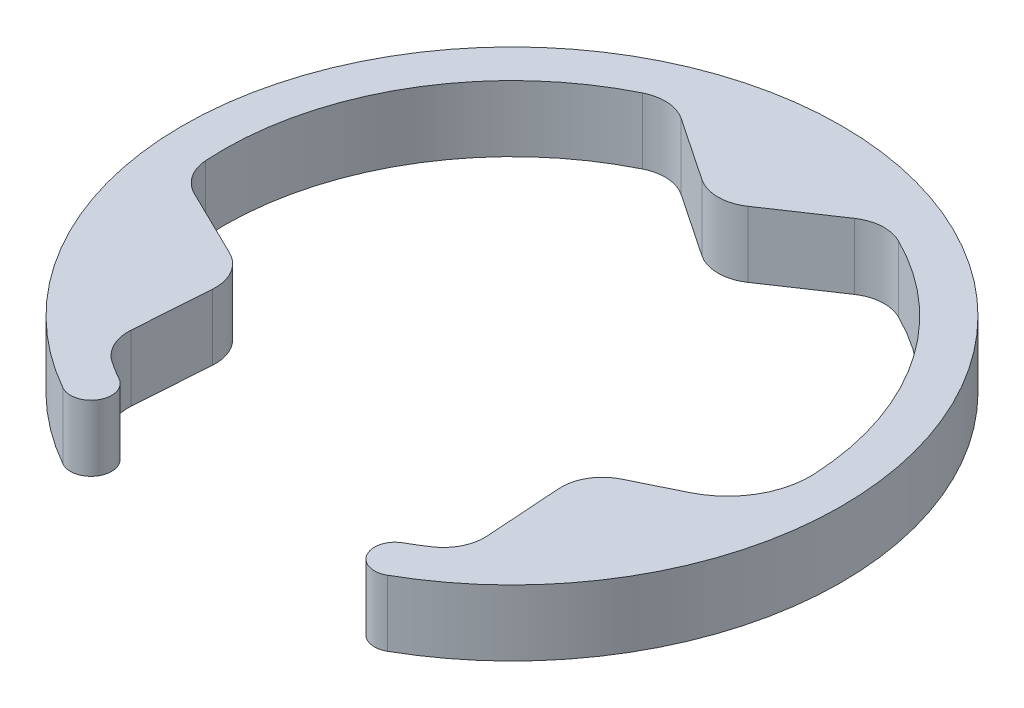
ISO-10303-21;
HEADER;
FILE_DESCRIPTION(('STEP AP214'),'2;1');
FILE_NAME('part.step','',(''),(''),'','','');
FILE_SCHEMA(('AUTOMOTIVE_DESIGN { 1 0 10303 214 1 1 1 1 }'));
ENDSEC;
DATA;
#1=APPLICATION_CONTEXT('core data for automotive mechanical design processes');
#2=APPLICATION_PROTOCOL_DEFINITION('international standard','automotive_design',2000,#1);
#3=PRODUCT_CONTEXT('',#1,'mechanical');
#4=PRODUCT('Part','Part','',(#3));
#5=PRODUCT_RELATED_PRODUCT_CATEGORY('part','',(#4));
#6=PRODUCT_DEFINITION_FORMATION('','',#4);
#7=PRODUCT_DEFINITION_CONTEXT('part definition',#1,'design');
#8=PRODUCT_DEFINITION('design','',#6,#7);
#9=PRODUCT_DEFINITION_SHAPE('','',#8);
#10=(LENGTH_UNIT() NAMED_UNIT(*) SI_UNIT(.MILLI.,.METRE.));
#11=(NAMED_UNIT(*) PLANE_ANGLE_UNIT() SI_UNIT($,.RADIAN.));
#12=(NAMED_UNIT(*) SI_UNIT($,.STERADIAN.) SOLID_ANGLE_UNIT());
#13=UNCERTAINTY_MEASURE_WITH_UNIT(LENGTH_MEASURE(1.E-05),#10,'distance_accuracy_value','');
#14=(GEOMETRIC_REPRESENTATION_CONTEXT(3) GLOBAL_UNCERTAINTY_ASSIGNED_CONTEXT((#13)) GLOBAL_UNIT_ASSIGNED_CONTEXT((#10,
#11,#12)) REPRESENTATION_CONTEXT('',''));
#15=CARTESIAN_POINT('',(0.,0.,0.));
#16=DIRECTION('',(0.,0.,1.));
#17=DIRECTION('',(1.,0.,0.));
#18=AXIS2_PLACEMENT_3D('',#15,#16,#17);
#19=CARTESIAN_POINT('',(1.66394913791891,0.,2.49625184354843));
#20=DIRECTION('',(0.,1.,0.));
#21=DIRECTION('',(0.,0.,1.));
#22=AXIS2_PLACEMENT_3D('',#19,#20,#21);
#23=CYLINDRICAL_SURFACE('',#22,0.499999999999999);
#24=CARTESIAN_POINT('',(1.66394913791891,0.8,2.49625184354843));
#25=DIRECTION('',(0.,-1.,0.));
#26=DIRECTION('',(0.,0.,-1.));
#27=AXIS2_PLACEMENT_3D('',#24,#25,#26);
#28=CIRCLE('',#27,0.499999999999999);
#29=CARTESIAN_POINT('',(2.1627811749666,0.8,2.46209633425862));
#30=VERTEX_POINT('',#29);
#31=CARTESIAN_POINT('',(1.94127399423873,0.8,2.91229381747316));
#32=VERTEX_POINT('',#31);
#33=EDGE_CURVE('E213',#30,#32,#28,.T.);
#34=ORIENTED_EDGE('',*,*,#33,.F.);
#35=DIRECTION('',(0.,1.,0.));
#36=VECTOR('',#35,1.);
#37=CARTESIAN_POINT('',(2.1627811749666,0.,2.46209633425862));
#38=LINE('',#37,#36);
#39=CARTESIAN_POINT('',(2.1627811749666,0.,2.46209633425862));
#40=VERTEX_POINT('',#39);
#41=EDGE_CURVE('E11',#40,#30,#38,.T.);
#42=ORIENTED_EDGE('',*,*,#41,.F.);
#43=CARTESIAN_POINT('',(1.66394913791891,0.,2.49625184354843));
#44=DIRECTION('',(0.,-1.,0.));
#45=DIRECTION('',(0.,0.,-1.));
#46=AXIS2_PLACEMENT_3D('',#43,#44,#45);
#47=CIRCLE('',#46,0.499999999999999);
#48=CARTESIAN_POINT('',(1.94127399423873,0.,2.91229381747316));
#49=VERTEX_POINT('',#48);
#50=EDGE_CURVE('E275',#40,#49,#47,.T.);
#51=ORIENTED_EDGE('',*,*,#50,.T.);
#52=DIRECTION('',(0.,1.,0.));
#53=VECTOR('',#52,1.);
#54=CARTESIAN_POINT('',(1.94127399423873,0.,2.91229381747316));
#55=LINE('',#54,#53);
#56=EDGE_CURVE('E35',#49,#32,#55,.T.);
#57=ORIENTED_EDGE('',*,*,#56,.T.);
#58=EDGE_LOOP('',(#34,#42,#51,#57));
#59=FACE_BOUND('',#58,.T.);
#60=ADVANCED_FACE('F32',(#59),#23,.F.);
#61=CARTESIAN_POINT('',(2.09924417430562,0.,1.53415550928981));
#62=DIRECTION('',(-0.997664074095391,0.,0.0683110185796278));
#63=DIRECTION('',(0.0683110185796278,0.,0.997664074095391));
#64=AXIS2_PLACEMENT_3D('',#61,#62,#63);
#65=PLANE('',#64);
#66=DIRECTION('',(0.0683110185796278,0.,0.997664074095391));
#67=VECTOR('',#66,1.);
#68=CARTESIAN_POINT('',(2.09924417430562,0.8,1.53415550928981));
#69=LINE('',#68,#67);
#70=CARTESIAN_POINT('',(2.09924417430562,0.8,1.53415550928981));
#71=VERTEX_POINT('',#70);
#72=EDGE_CURVE('E273',#71,#30,#69,.T.);
#73=ORIENTED_EDGE('',*,*,#72,.F.);
#74=DIRECTION('',(0.,1.,0.));
#75=VECTOR('',#74,1.);
#76=CARTESIAN_POINT('',(2.09924417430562,0.,1.53415550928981));
#77=LINE('',#76,#75);
#78=CARTESIAN_POINT('',(2.09924417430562,0.,1.53415550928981));
#79=VERTEX_POINT('',#78);
#80=EDGE_CURVE('E41',#79,#71,#77,.T.);
#81=ORIENTED_EDGE('',*,*,#80,.F.);
#82=DIRECTION('',(0.0683110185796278,0.,0.997664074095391));
#83=VECTOR('',#82,1.);
#84=CARTESIAN_POINT('',(2.09924417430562,0.,1.53415550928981));
#85=LINE('',#84,#83);
#86=EDGE_CURVE('E203',#79,#40,#85,.T.);
#87=ORIENTED_EDGE('',*,*,#86,.T.);
#88=ORIENTED_EDGE('',*,*,#41,.T.);
#89=EDGE_LOOP('',(#73,#81,#87,#88));
#90=FACE_BOUND('',#89,.T.);
#91=ADVANCED_FACE('F315',(#90),#65,.T.);
#92=CARTESIAN_POINT('',(2.59807621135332,0.,1.5));
#93=DIRECTION('',(0.,1.,0.));
#94=DIRECTION('',(0.,0.,1.));
#95=AXIS2_PLACEMENT_3D('',#92,#93,#94);
#96=CYLINDRICAL_SURFACE('',#95,0.5);
#97=CARTESIAN_POINT('',(2.59807621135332,0.8,1.5));
#98=DIRECTION('',(0.,1.,0.));
#99=DIRECTION('',(0.,0.,1.));
#100=AXIS2_PLACEMENT_3D('',#97,#98,#99);
#101=CIRCLE('',#100,0.5);
#102=CARTESIAN_POINT('',(2.37823973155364,0.8,1.05092102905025));
#103=VERTEX_POINT('',#102);
#104=EDGE_CURVE('E190',#103,#71,#101,.T.);
#105=ORIENTED_EDGE('',*,*,#104,.F.);
#106=DIRECTION('',(0.,1.,0.));
#107=VECTOR('',#106,1.);
#108=CARTESIAN_POINT('',(2.37823973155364,0.,1.05092102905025));
#109=LINE('',#108,#107);
#110=CARTESIAN_POINT('',(2.37823973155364,0.,1.05092102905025));
#111=VERTEX_POINT('',#110);
#112=EDGE_CURVE('E185',#111,#103,#109,.T.);
#113=ORIENTED_EDGE('',*,*,#112,.F.);
#114=CARTESIAN_POINT('',(2.59807621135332,0.,1.5));
#115=DIRECTION('',(0.,1.,0.));
#116=DIRECTION('',(0.,0.,1.));
#117=AXIS2_PLACEMENT_3D('',#114,#115,#116);
#118=CIRCLE('',#117,0.5);
#119=EDGE_CURVE('E188',#111,#79,#118,.T.);
#120=ORIENTED_EDGE('',*,*,#119,.T.);
#121=ORIENTED_EDGE('',*,*,#80,.T.);
#122=EDGE_LOOP('',(#105,#113,#120,#121));
#123=FACE_BOUND('',#122,.T.);
#124=ADVANCED_FACE('F187',(#123),#96,.T.);
#125=CARTESIAN_POINT('',(2.93676007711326,0.,0.777509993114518));
#126=DIRECTION('',(-0.439672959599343,0.,-0.898157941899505));
#127=DIRECTION('',(-0.898157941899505,0.,0.439672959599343));
#128=AXIS2_PLACEMENT_3D('',#125,#126,#127);
#129=PLANE('',#128);
#130=DIRECTION('',(-0.898157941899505,0.,0.439672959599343));
#131=VECTOR('',#130,1.);
#132=CARTESIAN_POINT('',(2.93676007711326,0.8,0.777509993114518));
#133=LINE('',#132,#131);
#134=CARTESIAN_POINT('',(2.93676007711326,0.8,0.777509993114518));
#135=VERTEX_POINT('',#134);
#136=EDGE_CURVE('E270',#135,#103,#133,.T.);
#137=ORIENTED_EDGE('',*,*,#136,.F.);
#138=DIRECTION('',(0.,1.,0.));
#139=VECTOR('',#138,1.);
#140=CARTESIAN_POINT('',(2.93676007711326,0.,0.777509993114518));
#141=LINE('',#140,#139);
#142=CARTESIAN_POINT('',(2.93676007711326,0.,0.777509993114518));
#143=VERTEX_POINT('',#142);
#144=EDGE_CURVE('E195',#143,#135,#141,.T.);
#145=ORIENTED_EDGE('',*,*,#144,.F.);
#146=DIRECTION('',(-0.898157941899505,0.,0.439672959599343));
#147=VECTOR('',#146,1.);
#148=CARTESIAN_POINT('',(2.93676007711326,0.,0.777509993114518));
#149=LINE('',#148,#147);
#150=EDGE_CURVE('E201',#143,#111,#149,.T.);
#151=ORIENTED_EDGE('',*,*,#150,.T.);
#152=ORIENTED_EDGE('',*,*,#112,.T.);
#153=EDGE_LOOP('',(#137,#145,#151,#152));
#154=FACE_BOUND('',#153,.T.);
#155=ADVANCED_FACE('F205',(#154),#129,.T.);
#156=CARTESIAN_POINT('',(2.49708711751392,0.,-0.120647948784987));
#157=DIRECTION('',(0.,1.,0.));
#158=DIRECTION('',(0.,0.,1.));
#159=AXIS2_PLACEMENT_3D('',#156,#157,#158);
#160=CYLINDRICAL_SURFACE('',#159,1.);
#161=CARTESIAN_POINT('',(2.49708711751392,0.8,-0.120647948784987));
#162=DIRECTION('',(0.,-1.,0.));
#163=DIRECTION('',(0.,0.,-1.));
#164=AXIS2_PLACEMENT_3D('',#161,#162,#163);
#165=CIRCLE('',#164,1.);
#166=CARTESIAN_POINT('',(3.49592196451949,0.8,-0.168907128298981));
#167=VERTEX_POINT('',#166);
#168=EDGE_CURVE('E267',#167,#135,#165,.T.);
#169=ORIENTED_EDGE('',*,*,#168,.F.);
#170=DIRECTION('',(0.,1.,0.));
#171=VECTOR('',#170,1.);
#172=CARTESIAN_POINT('',(3.49592196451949,0.,-0.168907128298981));
#173=LINE('',#172,#171);
#174=CARTESIAN_POINT('',(3.49592196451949,0.,-0.168907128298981));
#175=VERTEX_POINT('',#174);
#176=EDGE_CURVE('E279',#175,#167,#173,.T.);
#177=ORIENTED_EDGE('',*,*,#176,.F.);
#178=CARTESIAN_POINT('',(2.49708711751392,0.,-0.120647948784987));
#179=DIRECTION('',(0.,-1.,0.));
#180=DIRECTION('',(0.,0.,-1.));
#181=AXIS2_PLACEMENT_3D('',#178,#179,#180);
#182=CIRCLE('',#181,1.);
#183=EDGE_CURVE('E206',#175,#143,#182,.T.);
#184=ORIENTED_EDGE('',*,*,#183,.T.);
#185=ORIENTED_EDGE('',*,*,#144,.T.);
#186=EDGE_LOOP('',(#169,#177,#184,#185));
#187=FACE_BOUND('',#186,.T.);
#188=ADVANCED_FACE('F328',(#187),#160,.F.);
#189=CARTESIAN_POINT('',(0.,0.,0.));
#190=DIRECTION('',(0.,1.,0.));
#191=DIRECTION('',(0.,0.,1.));
#192=AXIS2_PLACEMENT_3D('',#189,#190,#191);
#193=CYLINDRICAL_SURFACE('',#192,3.5);
#194=CARTESIAN_POINT('',(0.,0.8,0.));
#195=DIRECTION('',(0.,-1.,0.));
#196=DIRECTION('',(0.,0.,-1.));
#197=AXIS2_PLACEMENT_3D('',#194,#195,#196);
#198=CIRCLE('',#197,3.5);
#199=CARTESIAN_POINT('',(1.55148343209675,0.8,-3.13733950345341));
#200=VERTEX_POINT('',#199);
#201=EDGE_CURVE('E264',#200,#167,#198,.T.);
#202=ORIENTED_EDGE('',*,*,#201,.F.);
#203=DIRECTION('',(0.,1.,0.));
#204=VECTOR('',#203,1.);
#205=CARTESIAN_POINT('',(1.55148343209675,0.,-3.13733950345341));
#206=LINE('',#205,#204);
#207=CARTESIAN_POINT('',(1.55148343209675,0.,-3.13733950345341));
#208=VERTEX_POINT('',#207);
#209=EDGE_CURVE('E281',#208,#200,#206,.T.);
#210=ORIENTED_EDGE('',*,*,#209,.F.);
#211=CARTESIAN_POINT('',(0.,0.,0.));
#212=DIRECTION('',(0.,-1.,0.));
#213=DIRECTION('',(0.,0.,-1.));
#214=AXIS2_PLACEMENT_3D('',#211,#212,#213);
#215=CIRCLE('',#214,3.5);
#216=EDGE_CURVE('E208',#208,#175,#215,.T.);
#217=ORIENTED_EDGE('',*,*,#216,.T.);
#218=ORIENTED_EDGE('',*,*,#176,.T.);
#219=EDGE_LOOP('',(#202,#210,#217,#218));
#220=FACE_BOUND('',#219,.T.);
#221=ADVANCED_FACE('F331',(#220),#193,.F.);
#222=CARTESIAN_POINT('',(1.32984294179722,0.,-2.68914814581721));
#223=DIRECTION('',(0.,1.,0.));
#224=DIRECTION('',(0.,0.,1.));
#225=AXIS2_PLACEMENT_3D('',#222,#223,#224);
#226=CYLINDRICAL_SURFACE('',#225,0.5);
#227=CARTESIAN_POINT('',(1.32984294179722,0.8,-2.68914814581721));
#228=DIRECTION('',(0.,-1.,0.));
#229=DIRECTION('',(0.,0.,-1.));
#230=AXIS2_PLACEMENT_3D('',#227,#228,#229);
#231=CIRCLE('',#230,0.5);
#232=CARTESIAN_POINT('',(1.0508473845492,0.8,-3.10407160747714));
#233=VERTEX_POINT('',#232);
#234=EDGE_CURVE('E261',#233,#200,#231,.T.);
#235=ORIENTED_EDGE('',*,*,#234,.F.);
#236=DIRECTION('',(0.,1.,0.));
#237=VECTOR('',#236,1.);
#238=CARTESIAN_POINT('',(1.0508473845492,0.,-3.10407160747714));
#239=LINE('',#238,#237);
#240=CARTESIAN_POINT('',(1.0508473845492,0.,-3.10407160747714));
#241=VERTEX_POINT('',#240);
#242=EDGE_CURVE('E283',#241,#233,#239,.T.);
#243=ORIENTED_EDGE('',*,*,#242,.F.);
#244=CARTESIAN_POINT('',(1.32984294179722,0.,-2.68914814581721));
#245=DIRECTION('',(0.,-1.,0.));
#246=DIRECTION('',(0.,0.,-1.));
#247=AXIS2_PLACEMENT_3D('',#244,#245,#246);
#248=CIRCLE('',#247,0.5);
#249=EDGE_CURVE('E594',#241,#208,#248,.T.);
#250=ORIENTED_EDGE('',*,*,#249,.T.);
#251=ORIENTED_EDGE('',*,*,#209,.T.);
#252=EDGE_LOOP('',(#235,#243,#250,#251));
#253=FACE_BOUND('',#252,.T.);
#254=ADVANCED_FACE('F335',(#253),#226,.F.);
#255=CARTESIAN_POINT('',(0.278995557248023,0.,-2.58507653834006));
#256=DIRECTION('',(0.557991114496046,0.,0.829846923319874));
#257=DIRECTION('',(0.829846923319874,0.,-0.557991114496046));
#258=AXIS2_PLACEMENT_3D('',#255,#256,#257);
#259=PLANE('',#258);
#260=DIRECTION('',(0.829846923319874,0.,-0.557991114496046));
#261=VECTOR('',#260,1.);
#262=CARTESIAN_POINT('',(0.278995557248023,0.8,-2.58507653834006));
#263=LINE('',#262,#261);
#264=CARTESIAN_POINT('',(0.278995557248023,0.8,-2.58507653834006));
#265=VERTEX_POINT('',#264);
#266=EDGE_CURVE('E258',#265,#233,#263,.T.);
#267=ORIENTED_EDGE('',*,*,#266,.F.);
#268=DIRECTION('',(0.,1.,0.));
#269=VECTOR('',#268,1.);
#270=CARTESIAN_POINT('',(0.278995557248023,0.,-2.58507653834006));
#271=LINE('',#270,#269);
#272=CARTESIAN_POINT('',(0.278995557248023,0.,-2.58507653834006));
#273=VERTEX_POINT('',#272);
#274=EDGE_CURVE('E285',#273,#265,#271,.T.);
#275=ORIENTED_EDGE('',*,*,#274,.F.);
#276=DIRECTION('',(0.829846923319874,0.,-0.557991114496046));
#277=VECTOR('',#276,1.);
#278=CARTESIAN_POINT('',(0.278995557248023,0.,-2.58507653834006));
#279=LINE('',#278,#277);
#280=EDGE_CURVE('E590',#273,#241,#279,.T.);
#281=ORIENTED_EDGE('',*,*,#280,.T.);
#282=ORIENTED_EDGE('',*,*,#242,.T.);
#283=EDGE_LOOP('',(#267,#275,#281,#282));
#284=FACE_BOUND('',#283,.T.);
#285=ADVANCED_FACE('F339',(#284),#259,.T.);
#286=CARTESIAN_POINT('',(0.,0.,-3.));
#287=DIRECTION('',(0.,1.,0.));
#288=DIRECTION('',(0.,0.,1.));
#289=AXIS2_PLACEMENT_3D('',#286,#287,#288);
#290=CYLINDRICAL_SURFACE('',#289,0.499999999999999);
#291=CARTESIAN_POINT('',(0.,0.8,-3.));
#292=DIRECTION('',(0.,1.,0.));
#293=DIRECTION('',(0.,0.,1.));
#294=AXIS2_PLACEMENT_3D('',#291,#292,#293);
#295=CIRCLE('',#294,0.499999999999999);
#296=CARTESIAN_POINT('',(-0.278995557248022,0.8,-2.58507653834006));
#297=VERTEX_POINT('',#296);
#298=EDGE_CURVE('E255',#297,#265,#295,.T.);
#299=ORIENTED_EDGE('',*,*,#298,.F.);
#300=DIRECTION('',(0.,1.,0.));
#301=VECTOR('',#300,1.);
#302=CARTESIAN_POINT('',(-0.278995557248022,0.,-2.58507653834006));
#303=LINE('',#302,#301);
#304=CARTESIAN_POINT('',(-0.278995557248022,0.,-2.58507653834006));
#305=VERTEX_POINT('',#304);
#306=EDGE_CURVE('E287',#305,#297,#303,.T.);
#307=ORIENTED_EDGE('',*,*,#306,.F.);
#308=CARTESIAN_POINT('',(0.,0.,-3.));
#309=DIRECTION('',(0.,1.,0.));
#310=DIRECTION('',(0.,0.,1.));
#311=AXIS2_PLACEMENT_3D('',#308,#309,#310);
#312=CIRCLE('',#311,0.499999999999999);
#313=EDGE_CURVE('E601',#305,#273,#312,.T.);
#314=ORIENTED_EDGE('',*,*,#313,.T.);
#315=ORIENTED_EDGE('',*,*,#274,.T.);
#316=EDGE_LOOP('',(#299,#307,#314,#315));
#317=FACE_BOUND('',#316,.T.);
#318=ADVANCED_FACE('F343',(#317),#290,.T.);
#319=CARTESIAN_POINT('',(-1.0508473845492,0.,-3.10407160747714));
#320=DIRECTION('',(-0.557991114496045,0.,0.829846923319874));
#321=DIRECTION('',(0.829846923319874,0.,0.557991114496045));
#322=AXIS2_PLACEMENT_3D('',#319,#320,#321);
#323=PLANE('',#322);
#324=DIRECTION('',(0.829846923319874,0.,0.557991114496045));
#325=VECTOR('',#324,1.);
#326=CARTESIAN_POINT('',(-1.0508473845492,0.8,-3.10407160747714));
#327=LINE('',#326,#325);
#328=CARTESIAN_POINT('',(-1.0508473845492,0.8,-3.10407160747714));
#329=VERTEX_POINT('',#328);
#330=EDGE_CURVE('E252',#329,#297,#327,.T.);
#331=ORIENTED_EDGE('',*,*,#330,.F.);
#332=DIRECTION('',(0.,1.,0.));
#333=VECTOR('',#332,1.);
#334=CARTESIAN_POINT('',(-1.0508473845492,0.,-3.10407160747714));
#335=LINE('',#334,#333);
#336=CARTESIAN_POINT('',(-1.0508473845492,0.,-3.10407160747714));
#337=VERTEX_POINT('',#336);
#338=EDGE_CURVE('E289',#337,#329,#335,.T.);
#339=ORIENTED_EDGE('',*,*,#338,.F.);
#340=DIRECTION('',(0.829846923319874,0.,0.557991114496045));
#341=VECTOR('',#340,1.);
#342=CARTESIAN_POINT('',(-1.0508473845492,0.,-3.10407160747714));
#343=LINE('',#342,#341);
#344=EDGE_CURVE('E583',#337,#305,#343,.T.);
#345=ORIENTED_EDGE('',*,*,#344,.T.);
#346=ORIENTED_EDGE('',*,*,#306,.T.);
#347=EDGE_LOOP('',(#331,#339,#345,#346));
#348=FACE_BOUND('',#347,.T.);
#349=ADVANCED_FACE('F347',(#348),#323,.T.);
#350=CARTESIAN_POINT('',(-1.32984294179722,0.,-2.68914814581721));
#351=DIRECTION('',(0.,1.,0.));
#352=DIRECTION('',(0.,0.,1.));
#353=AXIS2_PLACEMENT_3D('',#350,#351,#352);
#354=CYLINDRICAL_SURFACE('',#353,0.5);
#355=CARTESIAN_POINT('',(-1.32984294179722,0.8,-2.68914814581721));
#356=DIRECTION('',(0.,-1.,0.));
#357=DIRECTION('',(0.,0.,-1.));
#358=AXIS2_PLACEMENT_3D('',#355,#356,#357);
#359=CIRCLE('',#358,0.5);
#360=CARTESIAN_POINT('',(-1.55148343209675,0.8,-3.13733950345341));
#361=VERTEX_POINT('',#360);
#362=EDGE_CURVE('E249',#361,#329,#359,.T.);
#363=ORIENTED_EDGE('',*,*,#362,.F.);
#364=DIRECTION('',(0.,1.,0.));
#365=VECTOR('',#364,1.);
#366=CARTESIAN_POINT('',(-1.55148343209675,0.,-3.13733950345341));
#367=LINE('',#366,#365);
#368=CARTESIAN_POINT('',(-1.55148343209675,0.,-3.13733950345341));
#369=VERTEX_POINT('',#368);
#370=EDGE_CURVE('E291',#369,#361,#367,.T.);
#371=ORIENTED_EDGE('',*,*,#370,.F.);
#372=CARTESIAN_POINT('',(-1.32984294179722,0.,-2.68914814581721));
#373=DIRECTION('',(0.,-1.,0.));
#374=DIRECTION('',(0.,0.,-1.));
#375=AXIS2_PLACEMENT_3D('',#372,#373,#374);
#376=CIRCLE('',#375,0.5);
#377=EDGE_CURVE('E579',#369,#337,#376,.T.);
#378=ORIENTED_EDGE('',*,*,#377,.T.);
#379=ORIENTED_EDGE('',*,*,#338,.T.);
#380=EDGE_LOOP('',(#363,#371,#378,#379));
#381=FACE_BOUND('',#380,.T.);
#382=ADVANCED_FACE('F351',(#381),#354,.F.);
#383=CARTESIAN_POINT('',(0.,0.,0.));
#384=DIRECTION('',(0.,1.,0.));
#385=DIRECTION('',(0.,0.,1.));
#386=AXIS2_PLACEMENT_3D('',#383,#384,#385);
#387=CYLINDRICAL_SURFACE('',#386,3.5);
#388=CARTESIAN_POINT('',(0.,0.8,0.));
#389=DIRECTION('',(0.,-1.,0.));
#390=DIRECTION('',(0.,0.,-1.));
#391=AXIS2_PLACEMENT_3D('',#388,#389,#390);
#392=CIRCLE('',#391,3.5);
#393=CARTESIAN_POINT('',(-3.49275742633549,0.8,0.225045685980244));
#394=VERTEX_POINT('',#393);
#395=EDGE_CURVE('E246',#394,#361,#392,.T.);
#396=ORIENTED_EDGE('',*,*,#395,.F.);
#397=DIRECTION('',(0.,1.,0.));
#398=VECTOR('',#397,1.);
#399=CARTESIAN_POINT('',(-3.49275742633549,0.,0.225045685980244));
#400=LINE('',#399,#398);
#401=CARTESIAN_POINT('',(-3.49275742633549,0.,0.225045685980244));
#402=VERTEX_POINT('',#401);
#403=EDGE_CURVE('E293',#402,#394,#400,.T.);
#404=ORIENTED_EDGE('',*,*,#403,.F.);
#405=CARTESIAN_POINT('',(0.,0.,0.));
#406=DIRECTION('',(0.,-1.,0.));
#407=DIRECTION('',(0.,0.,-1.));
#408=AXIS2_PLACEMENT_3D('',#405,#406,#407);
#409=CIRCLE('',#408,3.5);
#410=EDGE_CURVE('E605',#402,#369,#409,.T.);
#411=ORIENTED_EDGE('',*,*,#410,.T.);
#412=ORIENTED_EDGE('',*,*,#370,.T.);
#413=EDGE_LOOP('',(#396,#404,#411,#412));
#414=FACE_BOUND('',#413,.T.);
#415=ADVANCED_FACE('F355',(#414),#387,.F.);
#416=CARTESIAN_POINT('',(-2.99379207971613,0.,0.19289630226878));
#417=DIRECTION('',(0.,1.,0.));
#418=DIRECTION('',(0.,0.,1.));
#419=AXIS2_PLACEMENT_3D('',#416,#417,#418);
#420=CYLINDRICAL_SURFACE('',#419,0.499999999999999);
#421=CARTESIAN_POINT('',(-2.99379207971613,0.8,0.19289630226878));
#422=DIRECTION('',(0.,-1.,0.));
#423=DIRECTION('',(0.,0.,-1.));
#424=AXIS2_PLACEMENT_3D('',#421,#422,#423);
#425=CIRCLE('',#424,0.499999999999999);
#426=CARTESIAN_POINT('',(-3.2136285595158,0.8,0.641975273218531));
#427=VERTEX_POINT('',#426);
#428=EDGE_CURVE('E243',#427,#394,#425,.T.);
#429=ORIENTED_EDGE('',*,*,#428,.F.);
#430=DIRECTION('',(0.,1.,0.));
#431=VECTOR('',#430,1.);
#432=CARTESIAN_POINT('',(-3.2136285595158,0.,0.641975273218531));
#433=LINE('',#432,#431);
#434=CARTESIAN_POINT('',(-3.2136285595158,0.,0.641975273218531));
#435=VERTEX_POINT('',#434);
#436=EDGE_CURVE('E295',#435,#427,#433,.T.);
#437=ORIENTED_EDGE('',*,*,#436,.F.);
#438=CARTESIAN_POINT('',(-2.99379207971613,0.,0.19289630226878));
#439=DIRECTION('',(0.,-1.,0.));
#440=DIRECTION('',(0.,0.,-1.));
#441=AXIS2_PLACEMENT_3D('',#438,#439,#440);
#442=CIRCLE('',#441,0.499999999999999);
#443=EDGE_CURVE('E572',#435,#402,#442,.T.);
#444=ORIENTED_EDGE('',*,*,#443,.T.);
#445=ORIENTED_EDGE('',*,*,#403,.T.);
#446=EDGE_LOOP('',(#429,#437,#444,#445));
#447=FACE_BOUND('',#446,.T.);
#448=ADVANCED_FACE('F359',(#447),#420,.F.);
#449=CARTESIAN_POINT('',(-2.37823973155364,0.,1.05092102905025));
#450=DIRECTION('',(0.439672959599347,0.,-0.898157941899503));
#451=DIRECTION('',(-0.898157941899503,0.,-0.439672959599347));
#452=AXIS2_PLACEMENT_3D('',#449,#450,#451);
#453=PLANE('',#452);
#454=DIRECTION('',(-0.898157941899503,0.,-0.439672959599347));
#455=VECTOR('',#454,1.);
#456=CARTESIAN_POINT('',(-2.37823973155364,0.8,1.05092102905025));
#457=LINE('',#456,#455);
#458=CARTESIAN_POINT('',(-2.37823973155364,0.8,1.05092102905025));
#459=VERTEX_POINT('',#458);
#460=EDGE_CURVE('E240',#459,#427,#457,.T.);
#461=ORIENTED_EDGE('',*,*,#460,.F.);
#462=DIRECTION('',(0.,1.,0.));
#463=VECTOR('',#462,1.);
#464=CARTESIAN_POINT('',(-2.37823973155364,0.,1.05092102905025));
#465=LINE('',#464,#463);
#466=CARTESIAN_POINT('',(-2.37823973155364,0.,1.05092102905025));
#467=VERTEX_POINT('',#466);
#468=EDGE_CURVE('E297',#467,#459,#465,.T.);
#469=ORIENTED_EDGE('',*,*,#468,.F.);
#470=DIRECTION('',(-0.898157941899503,0.,-0.439672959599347));
#471=VECTOR('',#470,1.);
#472=CARTESIAN_POINT('',(-2.37823973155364,0.,1.05092102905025));
#473=LINE('',#472,#471);
#474=EDGE_CURVE('E568',#467,#435,#473,.T.);
#475=ORIENTED_EDGE('',*,*,#474,.T.);
#476=ORIENTED_EDGE('',*,*,#436,.T.);
#477=EDGE_LOOP('',(#461,#469,#475,#476));
#478=FACE_BOUND('',#477,.T.);
#479=ADVANCED_FACE('F363',(#478),#453,.T.);
#480=CARTESIAN_POINT('',(-2.59807621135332,0.,1.5));
#481=DIRECTION('',(0.,1.,0.));
#482=DIRECTION('',(0.,0.,1.));
#483=AXIS2_PLACEMENT_3D('',#480,#481,#482);
#484=CYLINDRICAL_SURFACE('',#483,0.499999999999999);
#485=CARTESIAN_POINT('',(-2.59807621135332,0.8,1.5));
#486=DIRECTION('',(0.,1.,0.));
#487=DIRECTION('',(0.,0.,1.));
#488=AXIS2_PLACEMENT_3D('',#485,#486,#487);
#489=CIRCLE('',#488,0.499999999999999);
#490=CARTESIAN_POINT('',(-2.09924417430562,0.8,1.53415550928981));
#491=VERTEX_POINT('',#490);
#492=EDGE_CURVE('E237',#491,#459,#489,.T.);
#493=ORIENTED_EDGE('',*,*,#492,.F.);
#494=DIRECTION('',(0.,1.,0.));
#495=VECTOR('',#494,1.);
#496=CARTESIAN_POINT('',(-2.09924417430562,0.,1.53415550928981));
#497=LINE('',#496,#495);
#498=CARTESIAN_POINT('',(-2.09924417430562,0.,1.53415550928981));
#499=VERTEX_POINT('',#498);
#500=EDGE_CURVE('E299',#499,#491,#497,.T.);
#501=ORIENTED_EDGE('',*,*,#500,.F.);
#502=CARTESIAN_POINT('',(-2.59807621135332,0.,1.5));
#503=DIRECTION('',(0.,1.,0.));
#504=DIRECTION('',(0.,0.,1.));
#505=AXIS2_PLACEMENT_3D('',#502,#503,#504);
#506=CIRCLE('',#505,0.499999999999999);
#507=EDGE_CURVE('E609',#499,#467,#506,.T.);
#508=ORIENTED_EDGE('',*,*,#507,.T.);
#509=ORIENTED_EDGE('',*,*,#468,.T.);
#510=EDGE_LOOP('',(#493,#501,#508,#509));
#511=FACE_BOUND('',#510,.T.);
#512=ADVANCED_FACE('F367',(#511),#484,.T.);
#513=CARTESIAN_POINT('',(-2.16278117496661,0.,2.46209633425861));
#514=DIRECTION('',(0.997664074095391,0.,0.068311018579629));
#515=DIRECTION('',(0.068311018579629,0.,-0.997664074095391));
#516=AXIS2_PLACEMENT_3D('',#513,#514,#515);
#517=PLANE('',#516);
#518=DIRECTION('',(0.068311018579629,0.,-0.997664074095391));
#519=VECTOR('',#518,1.);
#520=CARTESIAN_POINT('',(-2.16278117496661,0.8,2.46209633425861));
#521=LINE('',#520,#519);
#522=CARTESIAN_POINT('',(-2.16278117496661,0.8,2.46209633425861));
#523=VERTEX_POINT('',#522);
#524=EDGE_CURVE('E234',#523,#491,#521,.T.);
#525=ORIENTED_EDGE('',*,*,#524,.F.);
#526=DIRECTION('',(0.,1.,0.));
#527=VECTOR('',#526,1.);
#528=CARTESIAN_POINT('',(-2.16278117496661,0.,2.46209633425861));
#529=LINE('',#528,#527);
#530=CARTESIAN_POINT('',(-2.16278117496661,0.,2.46209633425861));
#531=VERTEX_POINT('',#530);
#532=EDGE_CURVE('E301',#531,#523,#529,.T.);
#533=ORIENTED_EDGE('',*,*,#532,.F.);
#534=DIRECTION('',(0.068311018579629,0.,-0.997664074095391));
#535=VECTOR('',#534,1.);
#536=CARTESIAN_POINT('',(-2.16278117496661,0.,2.46209633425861));
#537=LINE('',#536,#535);
#538=EDGE_CURVE('E561',#531,#499,#537,.T.);
#539=ORIENTED_EDGE('',*,*,#538,.T.);
#540=ORIENTED_EDGE('',*,*,#500,.T.);
#541=EDGE_LOOP('',(#525,#533,#539,#540));
#542=FACE_BOUND('',#541,.T.);
#543=ADVANCED_FACE('F371',(#542),#517,.T.);
#544=CARTESIAN_POINT('',(-1.66394913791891,0.,2.49625184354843));
#545=DIRECTION('',(0.,1.,0.));
#546=DIRECTION('',(0.,0.,1.));
#547=AXIS2_PLACEMENT_3D('',#544,#545,#546);
#548=CYLINDRICAL_SURFACE('',#547,0.499999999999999);
#549=CARTESIAN_POINT('',(-1.66394913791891,0.8,2.49625184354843));
#550=DIRECTION('',(0.,-1.,0.));
#551=DIRECTION('',(0.,0.,-1.));
#552=AXIS2_PLACEMENT_3D('',#549,#550,#551);
#553=CIRCLE('',#552,0.499999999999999);
#554=CARTESIAN_POINT('',(-1.94127399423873,0.8,2.91229381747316));
#555=VERTEX_POINT('',#554);
#556=EDGE_CURVE('E231',#555,#523,#553,.T.);
#557=ORIENTED_EDGE('',*,*,#556,.F.);
#558=DIRECTION('',(0.,1.,0.));
#559=VECTOR('',#558,1.);
#560=CARTESIAN_POINT('',(-1.94127399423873,0.,2.91229381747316));
#561=LINE('',#560,#559);
#562=CARTESIAN_POINT('',(-1.94127399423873,0.,2.91229381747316));
#563=VERTEX_POINT('',#562);
#564=EDGE_CURVE('E303',#563,#555,#561,.T.);
#565=ORIENTED_EDGE('',*,*,#564,.F.);
#566=CARTESIAN_POINT('',(-1.66394913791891,0.,2.49625184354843));
#567=DIRECTION('',(0.,-1.,0.));
#568=DIRECTION('',(0.,0.,-1.));
#569=AXIS2_PLACEMENT_3D('',#566,#567,#568);
#570=CIRCLE('',#569,0.499999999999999);
#571=EDGE_CURVE('E557',#563,#531,#570,.T.);
#572=ORIENTED_EDGE('',*,*,#571,.T.);
#573=ORIENTED_EDGE('',*,*,#532,.T.);
#574=EDGE_LOOP('',(#557,#565,#572,#573));
#575=FACE_BOUND('',#574,.T.);
#576=ADVANCED_FACE('F375',(#575),#548,.F.);
#577=CARTESIAN_POINT('',(0.,0.,0.));
#578=DIRECTION('',(0.,1.,0.));
#579=DIRECTION('',(0.,0.,1.));
#580=AXIS2_PLACEMENT_3D('',#577,#578,#579);
#581=CYLINDRICAL_SURFACE('',#580,3.5);
#582=CARTESIAN_POINT('',(0.,0.8,0.));
#583=DIRECTION('',(0.,-1.,0.));
#584=DIRECTION('',(0.,0.,-1.));
#585=AXIS2_PLACEMENT_3D('',#582,#583,#584);
#586=CIRCLE('',#585,3.5);
#587=CARTESIAN_POINT('',(-1.72236602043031,0.8,3.0468763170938));
#588=VERTEX_POINT('',#587);
#589=EDGE_CURVE('E228',#588,#555,#586,.T.);
#590=ORIENTED_EDGE('',*,*,#589,.F.);
#591=DIRECTION('',(0.,1.,0.));
#592=VECTOR('',#591,1.);
#593=CARTESIAN_POINT('',(-1.72236602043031,0.,3.0468763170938));
#594=LINE('',#593,#592);
#595=CARTESIAN_POINT('',(-1.72236602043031,0.,3.0468763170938));
#596=VERTEX_POINT('',#595);
#597=EDGE_CURVE('E305',#596,#588,#594,.T.);
#598=ORIENTED_EDGE('',*,*,#597,.F.);
#599=CARTESIAN_POINT('',(0.,0.,0.));
#600=DIRECTION('',(0.,-1.,0.));
#601=DIRECTION('',(0.,0.,-1.));
#602=AXIS2_PLACEMENT_3D('',#599,#600,#601);
#603=CIRCLE('',#602,3.5);
#604=EDGE_CURVE('E613',#596,#563,#603,.T.);
#605=ORIENTED_EDGE('',*,*,#604,.T.);
#606=ORIENTED_EDGE('',*,*,#564,.T.);
#607=EDGE_LOOP('',(#590,#598,#605,#606));
#608=FACE_BOUND('',#607,.T.);
#609=ADVANCED_FACE('F379',(#608),#581,.F.);
#610=CARTESIAN_POINT('',(-1.84539216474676,0.,3.26451033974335));
#611=DIRECTION('',(0.,1.,0.));
#612=DIRECTION('',(0.,0.,1.));
#613=AXIS2_PLACEMENT_3D('',#610,#611,#612);
#614=CYLINDRICAL_SURFACE('',#613,0.25);
#615=CARTESIAN_POINT('',(-1.84539216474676,0.8,3.26451033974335));
#616=DIRECTION('',(0.,1.,0.));
#617=DIRECTION('',(0.,0.,1.));
#618=AXIS2_PLACEMENT_3D('',#615,#616,#617);
#619=CIRCLE('',#618,0.25);
#620=CARTESIAN_POINT('',(-1.96841830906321,0.8,3.48214436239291));
#621=VERTEX_POINT('',#620);
#622=EDGE_CURVE('E225',#621,#588,#619,.T.);
#623=ORIENTED_EDGE('',*,*,#622,.F.);
#624=DIRECTION('',(0.,1.,0.));
#625=VECTOR('',#624,1.);
#626=CARTESIAN_POINT('',(-1.96841830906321,0.,3.48214436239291));
#627=LINE('',#626,#625);
#628=CARTESIAN_POINT('',(-1.96841830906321,0.,3.48214436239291));
#629=VERTEX_POINT('',#628);
#630=EDGE_CURVE('E307',#629,#621,#627,.T.);
#631=ORIENTED_EDGE('',*,*,#630,.F.);
#632=CARTESIAN_POINT('',(-1.84539216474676,0.,3.26451033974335));
#633=DIRECTION('',(0.,1.,0.));
#634=DIRECTION('',(0.,0.,1.));
#635=AXIS2_PLACEMENT_3D('',#632,#633,#634);
#636=CIRCLE('',#635,0.25);
#637=EDGE_CURVE('E550',#629,#596,#636,.T.);
#638=ORIENTED_EDGE('',*,*,#637,.T.);
#639=ORIENTED_EDGE('',*,*,#597,.T.);
#640=EDGE_LOOP('',(#623,#631,#638,#639));
#641=FACE_BOUND('',#640,.T.);
#642=ADVANCED_FACE('F383',(#641),#614,.T.);
#643=CARTESIAN_POINT('',(0.,0.,0.));
#644=DIRECTION('',(0.,1.,0.));
#645=DIRECTION('',(0.,0.,1.));
#646=AXIS2_PLACEMENT_3D('',#643,#644,#645);
#647=CYLINDRICAL_SURFACE('',#646,4.);
#648=CARTESIAN_POINT('',(0.,0.8,0.));
#649=DIRECTION('',(0.,1.,0.));
#650=DIRECTION('',(0.,0.,1.));
#651=AXIS2_PLACEMENT_3D('',#648,#649,#650);
#652=CIRCLE('',#651,4.);
#653=CARTESIAN_POINT('',(1.96841830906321,0.8,3.48214436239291));
#654=VERTEX_POINT('',#653);
#655=EDGE_CURVE('E222',#654,#621,#652,.T.);
#656=ORIENTED_EDGE('',*,*,#655,.F.);
#657=DIRECTION('',(0.,1.,0.));
#658=VECTOR('',#657,1.);
#659=CARTESIAN_POINT('',(1.96841830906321,0.,3.48214436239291));
#660=LINE('',#659,#658);
#661=CARTESIAN_POINT('',(1.96841830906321,0.,3.48214436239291));
#662=VERTEX_POINT('',#661);
#663=EDGE_CURVE('E309',#662,#654,#660,.T.);
#664=ORIENTED_EDGE('',*,*,#663,.F.);
#665=CARTESIAN_POINT('',(0.,0.,0.));
#666=DIRECTION('',(0.,1.,0.));
#667=DIRECTION('',(0.,0.,1.));
#668=AXIS2_PLACEMENT_3D('',#665,#666,#667);
#669=CIRCLE('',#668,4.);
#670=EDGE_CURVE('E546',#662,#629,#669,.T.);
#671=ORIENTED_EDGE('',*,*,#670,.T.);
#672=ORIENTED_EDGE('',*,*,#630,.T.);
#673=EDGE_LOOP('',(#656,#664,#671,#672));
#674=FACE_BOUND('',#673,.T.);
#675=ADVANCED_FACE('F387',(#674),#647,.T.);
#676=CARTESIAN_POINT('',(1.84539216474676,0.,3.26451033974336));
#677=DIRECTION('',(0.,1.,0.));
#678=DIRECTION('',(0.,0.,1.));
#679=AXIS2_PLACEMENT_3D('',#676,#677,#678);
#680=CYLINDRICAL_SURFACE('',#679,0.25);
#681=CARTESIAN_POINT('',(1.84539216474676,0.8,3.26451033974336));
#682=DIRECTION('',(0.,1.,0.));
#683=DIRECTION('',(0.,0.,1.));
#684=AXIS2_PLACEMENT_3D('',#681,#682,#683);
#685=CIRCLE('',#684,0.25);
#686=CARTESIAN_POINT('',(1.72236602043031,0.8,3.0468763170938));
#687=VERTEX_POINT('',#686);
#688=EDGE_CURVE('E219',#687,#654,#685,.T.);
#689=ORIENTED_EDGE('',*,*,#688,.F.);
#690=DIRECTION('',(0.,1.,0.));
#691=VECTOR('',#690,1.);
#692=CARTESIAN_POINT('',(1.72236602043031,0.,3.0468763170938));
#693=LINE('',#692,#691);
#694=CARTESIAN_POINT('',(1.72236602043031,0.,3.0468763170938));
#695=VERTEX_POINT('',#694);
#696=EDGE_CURVE('E310',#695,#687,#693,.T.);
#697=ORIENTED_EDGE('',*,*,#696,.F.);
#698=CARTESIAN_POINT('',(1.84539216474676,0.,3.26451033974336));
#699=DIRECTION('',(0.,1.,0.));
#700=DIRECTION('',(0.,0.,1.));
#701=AXIS2_PLACEMENT_3D('',#698,#699,#700);
#702=CIRCLE('',#701,0.25);
#703=EDGE_CURVE('E617',#695,#662,#702,.T.);
#704=ORIENTED_EDGE('',*,*,#703,.T.);
#705=ORIENTED_EDGE('',*,*,#663,.T.);
#706=EDGE_LOOP('',(#689,#697,#704,#705));
#707=FACE_BOUND('',#706,.T.);
#708=ADVANCED_FACE('F391',(#707),#680,.T.);
#709=CARTESIAN_POINT('',(0.,0.,0.));
#710=DIRECTION('',(0.,1.,0.));
#711=DIRECTION('',(0.,0.,1.));
#712=AXIS2_PLACEMENT_3D('',#709,#710,#711);
#713=CYLINDRICAL_SURFACE('',#712,3.5);
#714=CARTESIAN_POINT('',(0.,0.8,0.));
#715=DIRECTION('',(0.,-1.,0.));
#716=DIRECTION('',(0.,0.,-1.));
#717=AXIS2_PLACEMENT_3D('',#714,#715,#716);
#718=CIRCLE('',#717,3.5);
#719=EDGE_CURVE('E216',#32,#687,#718,.T.);
#720=ORIENTED_EDGE('',*,*,#719,.F.);
#721=ORIENTED_EDGE('',*,*,#56,.F.);
#722=CARTESIAN_POINT('',(0.,0.,0.));
#723=DIRECTION('',(0.,-1.,0.));
#724=DIRECTION('',(0.,0.,-1.));
#725=AXIS2_PLACEMENT_3D('',#722,#723,#724);
#726=CIRCLE('',#725,3.5);
#727=EDGE_CURVE('E619',#49,#695,#726,.T.);
#728=ORIENTED_EDGE('',*,*,#727,.T.);
#729=ORIENTED_EDGE('',*,*,#696,.T.);
#730=EDGE_LOOP('',(#720,#721,#728,#729));
#731=FACE_BOUND('',#730,.T.);
#732=ADVANCED_FACE('F312',(#731),#713,.F.);
#733=CARTESIAN_POINT('',(1.66394913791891,0.,2.49625184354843));
#734=DIRECTION('',(0.,-1.,0.));
#735=DIRECTION('',(0.,0.,-1.));
#736=AXIS2_PLACEMENT_3D('',#733,#734,#735);
#737=PLANE('',#736);
#738=ORIENTED_EDGE('',*,*,#50,.F.);
#739=ORIENTED_EDGE('',*,*,#86,.F.);
#740=ORIENTED_EDGE('',*,*,#119,.F.);
#741=ORIENTED_EDGE('',*,*,#150,.F.);
#742=ORIENTED_EDGE('',*,*,#183,.F.);
#743=ORIENTED_EDGE('',*,*,#216,.F.);
#744=ORIENTED_EDGE('',*,*,#249,.F.);
#745=ORIENTED_EDGE('',*,*,#280,.F.);
#746=ORIENTED_EDGE('',*,*,#313,.F.);
#747=ORIENTED_EDGE('',*,*,#344,.F.);
#748=ORIENTED_EDGE('',*,*,#377,.F.);
#749=ORIENTED_EDGE('',*,*,#410,.F.);
#750=ORIENTED_EDGE('',*,*,#443,.F.);
#751=ORIENTED_EDGE('',*,*,#474,.F.);
#752=ORIENTED_EDGE('',*,*,#507,.F.);
#753=ORIENTED_EDGE('',*,*,#538,.F.);
#754=ORIENTED_EDGE('',*,*,#571,.F.);
#755=ORIENTED_EDGE('',*,*,#604,.F.);
#756=ORIENTED_EDGE('',*,*,#637,.F.);
#757=ORIENTED_EDGE('',*,*,#670,.F.);
#758=ORIENTED_EDGE('',*,*,#703,.F.);
#759=ORIENTED_EDGE('',*,*,#727,.F.);
#760=EDGE_LOOP('',(#738,#739,#740,#741,#742,#743,#744,#745,#746,#747,#748,#749,#750,#751,#752,
#753,#754,#755,#756,#757,#758,#759));
#761=FACE_BOUND('',#760,.T.);
#762=ADVANCED_FACE('F199',(#761),#737,.T.);
#763=CARTESIAN_POINT('',(1.66394913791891,0.8,2.49625184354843));
#764=DIRECTION('',(0.,-1.,0.));
#765=DIRECTION('',(0.,0.,-1.));
#766=AXIS2_PLACEMENT_3D('',#763,#764,#765);
#767=PLANE('',#766);
#768=ORIENTED_EDGE('',*,*,#33,.T.);
#769=ORIENTED_EDGE('',*,*,#719,.T.);
#770=ORIENTED_EDGE('',*,*,#688,.T.);
#771=ORIENTED_EDGE('',*,*,#655,.T.);
#772=ORIENTED_EDGE('',*,*,#622,.T.);
#773=ORIENTED_EDGE('',*,*,#589,.T.);
#774=ORIENTED_EDGE('',*,*,#556,.T.);
#775=ORIENTED_EDGE('',*,*,#524,.T.);
#776=ORIENTED_EDGE('',*,*,#492,.T.);
#777=ORIENTED_EDGE('',*,*,#460,.T.);
#778=ORIENTED_EDGE('',*,*,#428,.T.);
#779=ORIENTED_EDGE('',*,*,#395,.T.);
#780=ORIENTED_EDGE('',*,*,#362,.T.);
#781=ORIENTED_EDGE('',*,*,#330,.T.);
#782=ORIENTED_EDGE('',*,*,#298,.T.);
#783=ORIENTED_EDGE('',*,*,#266,.T.);
#784=ORIENTED_EDGE('',*,*,#234,.T.);
#785=ORIENTED_EDGE('',*,*,#201,.T.);
#786=ORIENTED_EDGE('',*,*,#168,.T.);
#787=ORIENTED_EDGE('',*,*,#136,.T.);
#788=ORIENTED_EDGE('',*,*,#104,.T.);
#789=ORIENTED_EDGE('',*,*,#72,.T.);
#790=EDGE_LOOP('',(#768,#769,#770,#771,#772,#773,#774,#775,#776,#777,#778,#779,#780,#781,#782,
#783,#784,#785,#786,#787,#788,#789));
#791=FACE_BOUND('',#790,.T.);
#792=ADVANCED_FACE('F314',(#791),#767,.F.);
#793=CLOSED_SHELL('',(#60,#91,#124,#155,#188,#221,#254,#285,#318,#349,#382,#415,#448,#479,#512,
#543,#576,#609,#642,#675,#708,#732,#762,#792));
#794=MANIFOLD_SOLID_BREP('B2',#793);
#795=ADVANCED_BREP_SHAPE_REPRESENTATION('',(#18,#794),#14);
#796=SHAPE_DEFINITION_REPRESENTATION(#9,#795);
ENDSEC;
END-ISO-10303-21;
